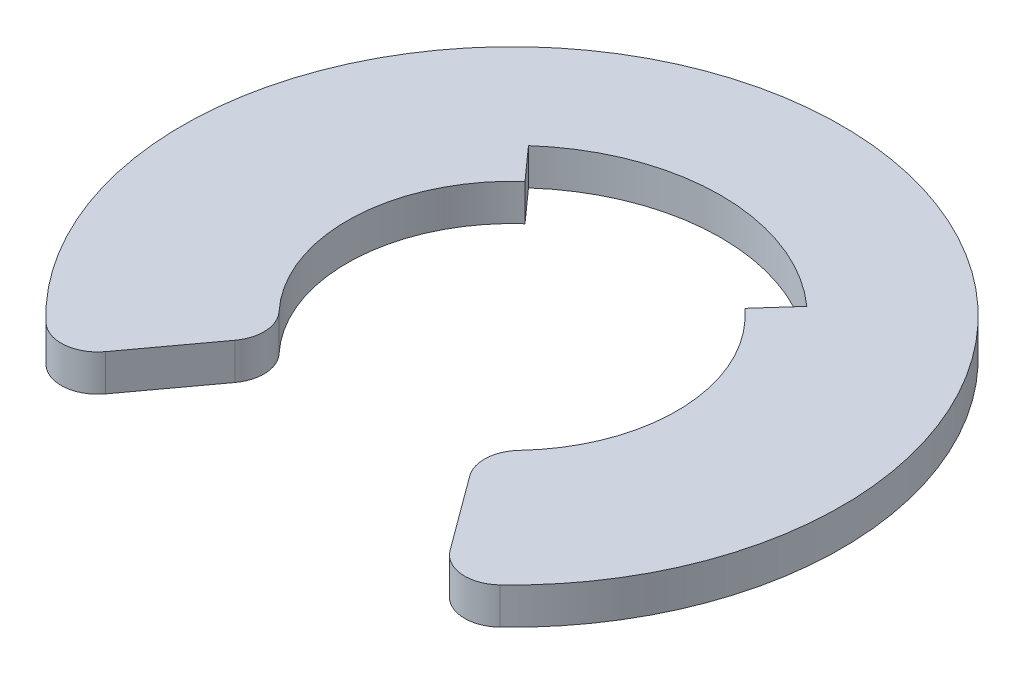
ISO-10303-21;
HEADER;
FILE_DESCRIPTION(('STEP AP214'),'2;1');
FILE_NAME('part.step','',(''),(''),'','','');
FILE_SCHEMA(('AUTOMOTIVE_DESIGN { 1 0 10303 214 1 1 1 1 }'));
ENDSEC;
DATA;
#1=APPLICATION_CONTEXT('core data for automotive mechanical design processes');
#2=APPLICATION_PROTOCOL_DEFINITION('international standard','automotive_design',2000,#1);
#3=PRODUCT_CONTEXT('',#1,'mechanical');
#4=PRODUCT('Part','Part','',(#3));
#5=PRODUCT_RELATED_PRODUCT_CATEGORY('part','',(#4));
#6=PRODUCT_DEFINITION_FORMATION('','',#4);
#7=PRODUCT_DEFINITION_CONTEXT('part definition',#1,'design');
#8=PRODUCT_DEFINITION('design','',#6,#7);
#9=PRODUCT_DEFINITION_SHAPE('','',#8);
#10=(LENGTH_UNIT() NAMED_UNIT(*) SI_UNIT(.MILLI.,.METRE.));
#11=(NAMED_UNIT(*) PLANE_ANGLE_UNIT() SI_UNIT($,.RADIAN.));
#12=(NAMED_UNIT(*) SI_UNIT($,.STERADIAN.) SOLID_ANGLE_UNIT());
#13=UNCERTAINTY_MEASURE_WITH_UNIT(LENGTH_MEASURE(1.E-05),#10,'distance_accuracy_value','');
#14=(GEOMETRIC_REPRESENTATION_CONTEXT(3) GLOBAL_UNCERTAINTY_ASSIGNED_CONTEXT((#13)) GLOBAL_UNIT_ASSIGNED_CONTEXT((#10,
#11,#12)) REPRESENTATION_CONTEXT('',''));
#15=CARTESIAN_POINT('',(0.,0.,0.));
#16=DIRECTION('',(0.,0.,1.));
#17=DIRECTION('',(1.,0.,0.));
#18=AXIS2_PLACEMENT_3D('',#15,#16,#17);
#19=CARTESIAN_POINT('',(0.,0.5,0.));
#20=DIRECTION('',(0.,1.,0.));
#21=DIRECTION('',(0.,0.,1.));
#22=AXIS2_PLACEMENT_3D('',#19,#20,#21);
#23=PLANE('',#22);
#24=CARTESIAN_POINT('',(0.,0.5,0.));
#25=DIRECTION('',(0.,1.,0.));
#26=DIRECTION('',(1.,0.,0.));
#27=AXIS2_PLACEMENT_3D('',#24,#25,#26);
#28=CIRCLE('',#27,2.85);
#29=CARTESIAN_POINT('',(1.9,0.5,-2.1242645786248));
#30=VERTEX_POINT('',#29);
#31=CARTESIAN_POINT('',(-1.9,0.5,-2.1242645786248));
#32=VERTEX_POINT('',#31);
#33=EDGE_CURVE('E135',#30,#32,#28,.T.);
#34=ORIENTED_EDGE('',*,*,#33,.F.);
#35=DIRECTION('',(-0.666666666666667,0.,0.74535599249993));
#36=VECTOR('',#35,1.);
#37=CARTESIAN_POINT('',(1.9,0.5,-2.1242645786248));
#38=LINE('',#37,#36);
#39=CARTESIAN_POINT('',(1.5,0.5,-1.67705098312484));
#40=VERTEX_POINT('',#39);
#41=EDGE_CURVE('E139',#30,#40,#38,.T.);
#42=ORIENTED_EDGE('',*,*,#41,.T.);
#43=CARTESIAN_POINT('',(0.,0.5,0.));
#44=DIRECTION('',(0.,1.,0.));
#45=DIRECTION('',(0.,0.,1.));
#46=AXIS2_PLACEMENT_3D('',#43,#44,#45);
#47=CIRCLE('',#46,2.25);
#48=CARTESIAN_POINT('',(1.64031567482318,0.5,1.54008586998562));
#49=VERTEX_POINT('',#48);
#50=EDGE_CURVE('E169',#49,#40,#47,.T.);
#51=ORIENTED_EDGE('',*,*,#50,.F.);
#52=CARTESIAN_POINT('',(2.00483026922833,0.5,1.88232717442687));
#53=DIRECTION('',(0.,1.,0.));
#54=DIRECTION('',(0.,0.,1.));
#55=AXIS2_PLACEMENT_3D('',#52,#53,#54);
#56=CIRCLE('',#55,0.5);
#57=CARTESIAN_POINT('',(1.60201800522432,0.5,2.1785404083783));
#58=VERTEX_POINT('',#57);
#59=EDGE_CURVE('E198',#49,#58,#56,.T.);
#60=ORIENTED_EDGE('',*,*,#59,.T.);
#61=DIRECTION('',(0.592426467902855,0.,0.805624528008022));
#62=VECTOR('',#61,1.);
#63=CARTESIAN_POINT('',(0.,0.5,0.));
#64=LINE('',#63,#62);
#65=CARTESIAN_POINT('',(2.35111965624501,0.5,3.19722322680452));
#66=VERTEX_POINT('',#65);
#67=EDGE_CURVE('E161',#58,#66,#64,.T.);
#68=ORIENTED_EDGE('',*,*,#67,.T.);
#69=CARTESIAN_POINT('',(2.75393192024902,0.5,2.9010099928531));
#70=DIRECTION('',(0.,1.,0.));
#71=DIRECTION('',(0.,0.,1.));
#72=AXIS2_PLACEMENT_3D('',#69,#70,#71);
#73=CIRCLE('',#72,0.5);
#74=CARTESIAN_POINT('',(3.09817341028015,0.5,3.26363624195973));
#75=VERTEX_POINT('',#74);
#76=EDGE_CURVE('E54',#66,#75,#73,.T.);
#77=ORIENTED_EDGE('',*,*,#76,.T.);
#78=CARTESIAN_POINT('',(0.,0.5,0.));
#79=DIRECTION('',(0.,1.,0.));
#80=DIRECTION('',(0.,0.,1.));
#81=AXIS2_PLACEMENT_3D('',#78,#79,#80);
#82=CIRCLE('',#81,4.5);
#83=CARTESIAN_POINT('',(-3.09817341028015,0.5,3.26363624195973));
#84=VERTEX_POINT('',#83);
#85=EDGE_CURVE('E172',#75,#84,#82,.T.);
#86=ORIENTED_EDGE('',*,*,#85,.T.);
#87=CARTESIAN_POINT('',(-2.75393192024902,0.5,2.9010099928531));
#88=DIRECTION('',(0.,1.,0.));
#89=DIRECTION('',(0.,0.,1.));
#90=AXIS2_PLACEMENT_3D('',#87,#88,#89);
#91=CIRCLE('',#90,0.5);
#92=CARTESIAN_POINT('',(-2.35111965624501,0.5,3.19722322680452));
#93=VERTEX_POINT('',#92);
#94=EDGE_CURVE('E201',#84,#93,#91,.T.);
#95=ORIENTED_EDGE('',*,*,#94,.T.);
#96=DIRECTION('',(0.592426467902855,0.,-0.805624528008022));
#97=VECTOR('',#96,1.);
#98=CARTESIAN_POINT('',(0.,0.5,0.));
#99=LINE('',#98,#97);
#100=CARTESIAN_POINT('',(-1.60201800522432,0.5,2.1785404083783));
#101=VERTEX_POINT('',#100);
#102=EDGE_CURVE('E155',#93,#101,#99,.T.);
#103=ORIENTED_EDGE('',*,*,#102,.T.);
#104=CARTESIAN_POINT('',(-2.00483026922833,0.5,1.88232717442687));
#105=DIRECTION('',(0.,1.,0.));
#106=DIRECTION('',(0.,0.,1.));
#107=AXIS2_PLACEMENT_3D('',#104,#105,#106);
#108=CIRCLE('',#107,0.5);
#109=CARTESIAN_POINT('',(-1.64031567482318,0.5,1.54008586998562));
#110=VERTEX_POINT('',#109);
#111=EDGE_CURVE('E195',#101,#110,#108,.T.);
#112=ORIENTED_EDGE('',*,*,#111,.T.);
#113=CARTESIAN_POINT('',(-1.5,0.5,-1.67705098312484));
#114=VERTEX_POINT('',#113);
#115=EDGE_CURVE('E164',#114,#110,#47,.T.);
#116=ORIENTED_EDGE('',*,*,#115,.F.);
#117=DIRECTION('',(-0.666666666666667,0.,-0.74535599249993));
#118=VECTOR('',#117,1.);
#119=CARTESIAN_POINT('',(-1.5,0.5,-1.67705098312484));
#120=LINE('',#119,#118);
#121=EDGE_CURVE('E46',#114,#32,#120,.T.);
#122=ORIENTED_EDGE('',*,*,#121,.T.);
#123=EDGE_LOOP('',(#34,#42,#51,#60,#68,#77,#86,#95,#103,#112,#116,#122));
#124=FACE_BOUND('',#123,.T.);
#125=ADVANCED_FACE('F31',(#124),#23,.T.);
#126=CARTESIAN_POINT('',(0.,0.,0.));
#127=DIRECTION('',(0.,1.,0.));
#128=DIRECTION('',(0.,0.,1.));
#129=AXIS2_PLACEMENT_3D('',#126,#127,#128);
#130=PLANE('',#129);
#131=DIRECTION('',(-0.666666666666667,0.,0.74535599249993));
#132=VECTOR('',#131,1.);
#133=CARTESIAN_POINT('',(1.9,0.,-2.1242645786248));
#134=LINE('',#133,#132);
#135=CARTESIAN_POINT('',(1.9,0.,-2.1242645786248));
#136=VERTEX_POINT('',#135);
#137=CARTESIAN_POINT('',(1.5,0.,-1.67705098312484));
#138=VERTEX_POINT('',#137);
#139=EDGE_CURVE('E127',#136,#138,#134,.T.);
#140=ORIENTED_EDGE('',*,*,#139,.F.);
#141=CARTESIAN_POINT('',(0.,0.,0.));
#142=DIRECTION('',(0.,1.,0.));
#143=DIRECTION('',(1.,0.,0.));
#144=AXIS2_PLACEMENT_3D('',#141,#142,#143);
#145=CIRCLE('',#144,2.85);
#146=CARTESIAN_POINT('',(-1.9,0.,-2.1242645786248));
#147=VERTEX_POINT('',#146);
#148=EDGE_CURVE('E128',#136,#147,#145,.T.);
#149=ORIENTED_EDGE('',*,*,#148,.T.);
#150=DIRECTION('',(-0.666666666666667,0.,-0.74535599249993));
#151=VECTOR('',#150,1.);
#152=CARTESIAN_POINT('',(-1.5,0.,-1.67705098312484));
#153=LINE('',#152,#151);
#154=CARTESIAN_POINT('',(-1.5,0.,-1.67705098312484));
#155=VERTEX_POINT('',#154);
#156=EDGE_CURVE('E118',#155,#147,#153,.T.);
#157=ORIENTED_EDGE('',*,*,#156,.F.);
#158=CARTESIAN_POINT('',(0.,0.,0.));
#159=DIRECTION('',(0.,1.,0.));
#160=DIRECTION('',(0.,0.,1.));
#161=AXIS2_PLACEMENT_3D('',#158,#159,#160);
#162=CIRCLE('',#161,2.25);
#163=CARTESIAN_POINT('',(-1.64031567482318,0.,1.54008586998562));
#164=VERTEX_POINT('',#163);
#165=EDGE_CURVE('E168',#155,#164,#162,.T.);
#166=ORIENTED_EDGE('',*,*,#165,.T.);
#167=CARTESIAN_POINT('',(-2.00483026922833,0.,1.88232717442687));
#168=DIRECTION('',(0.,1.,0.));
#169=DIRECTION('',(0.,0.,1.));
#170=AXIS2_PLACEMENT_3D('',#167,#168,#169);
#171=CIRCLE('',#170,0.5);
#172=CARTESIAN_POINT('',(-1.60201800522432,0.,2.1785404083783));
#173=VERTEX_POINT('',#172);
#174=EDGE_CURVE('E183',#164,#173,#171,.F.);
#175=ORIENTED_EDGE('',*,*,#174,.T.);
#176=DIRECTION('',(0.592426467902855,0.,-0.805624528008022));
#177=VECTOR('',#176,1.);
#178=CARTESIAN_POINT('',(0.,0.,0.));
#179=LINE('',#178,#177);
#180=CARTESIAN_POINT('',(-2.35111965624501,0.,3.19722322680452));
#181=VERTEX_POINT('',#180);
#182=EDGE_CURVE('E149',#181,#173,#179,.T.);
#183=ORIENTED_EDGE('',*,*,#182,.F.);
#184=CARTESIAN_POINT('',(-2.75393192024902,0.,2.9010099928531));
#185=DIRECTION('',(0.,1.,0.));
#186=DIRECTION('',(0.,0.,1.));
#187=AXIS2_PLACEMENT_3D('',#184,#185,#186);
#188=CIRCLE('',#187,0.5);
#189=CARTESIAN_POINT('',(-3.09817341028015,0.,3.26363624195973));
#190=VERTEX_POINT('',#189);
#191=EDGE_CURVE('E189',#181,#190,#188,.F.);
#192=ORIENTED_EDGE('',*,*,#191,.T.);
#193=CARTESIAN_POINT('',(0.,0.,0.));
#194=DIRECTION('',(0.,1.,0.));
#195=DIRECTION('',(0.,0.,1.));
#196=AXIS2_PLACEMENT_3D('',#193,#194,#195);
#197=CIRCLE('',#196,4.5);
#198=CARTESIAN_POINT('',(3.09817341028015,0.,3.26363624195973));
#199=VERTEX_POINT('',#198);
#200=EDGE_CURVE('E167',#199,#190,#197,.T.);
#201=ORIENTED_EDGE('',*,*,#200,.F.);
#202=CARTESIAN_POINT('',(2.75393192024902,0.,2.9010099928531));
#203=DIRECTION('',(0.,1.,0.));
#204=DIRECTION('',(0.,0.,1.));
#205=AXIS2_PLACEMENT_3D('',#202,#203,#204);
#206=CIRCLE('',#205,0.5);
#207=CARTESIAN_POINT('',(2.35111965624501,0.,3.19722322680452));
#208=VERTEX_POINT('',#207);
#209=EDGE_CURVE('E187',#199,#208,#206,.F.);
#210=ORIENTED_EDGE('',*,*,#209,.T.);
#211=DIRECTION('',(0.592426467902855,0.,0.805624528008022));
#212=VECTOR('',#211,1.);
#213=CARTESIAN_POINT('',(0.,0.,0.));
#214=LINE('',#213,#212);
#215=CARTESIAN_POINT('',(1.60201800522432,0.,2.1785404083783));
#216=VERTEX_POINT('',#215);
#217=EDGE_CURVE('E158',#216,#208,#214,.T.);
#218=ORIENTED_EDGE('',*,*,#217,.F.);
#219=CARTESIAN_POINT('',(2.00483026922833,0.,1.88232717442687));
#220=DIRECTION('',(0.,1.,0.));
#221=DIRECTION('',(0.,0.,1.));
#222=AXIS2_PLACEMENT_3D('',#219,#220,#221);
#223=CIRCLE('',#222,0.5);
#224=CARTESIAN_POINT('',(1.64031567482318,0.,1.54008586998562));
#225=VERTEX_POINT('',#224);
#226=EDGE_CURVE('E185',#216,#225,#223,.F.);
#227=ORIENTED_EDGE('',*,*,#226,.T.);
#228=EDGE_CURVE('E165',#225,#138,#162,.T.);
#229=ORIENTED_EDGE('',*,*,#228,.T.);
#230=EDGE_LOOP('',(#140,#149,#157,#166,#175,#183,#192,#201,#210,#218,#227,#229));
#231=FACE_BOUND('',#230,.T.);
#232=ADVANCED_FACE('F137',(#231),#130,.F.);
#233=CARTESIAN_POINT('',(0.,0.,0.));
#234=DIRECTION('',(0.,1.,0.));
#235=DIRECTION('',(0.,0.,1.));
#236=AXIS2_PLACEMENT_3D('',#233,#234,#235);
#237=CYLINDRICAL_SURFACE('',#236,2.25);
#238=DIRECTION('',(0.,1.,0.));
#239=VECTOR('',#238,1.);
#240=CARTESIAN_POINT('',(1.5,0.,-1.67705098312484));
#241=LINE('',#240,#239);
#242=EDGE_CURVE('E150',#138,#40,#241,.T.);
#243=ORIENTED_EDGE('',*,*,#242,.F.);
#244=ORIENTED_EDGE('',*,*,#228,.F.);
#245=DIRECTION('',(0.,1.,0.));
#246=VECTOR('',#245,1.);
#247=CARTESIAN_POINT('',(1.64031567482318,0.,1.54008586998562));
#248=LINE('',#247,#246);
#249=EDGE_CURVE('E11',#225,#49,#248,.T.);
#250=ORIENTED_EDGE('',*,*,#249,.T.);
#251=ORIENTED_EDGE('',*,*,#50,.T.);
#252=EDGE_LOOP('',(#243,#244,#250,#251));
#253=FACE_BOUND('',#252,.T.);
#254=ADVANCED_FACE('F242',(#253),#237,.F.);
#255=DIRECTION('',(0.,1.,0.));
#256=VECTOR('',#255,1.);
#257=CARTESIAN_POINT('',(-1.5,0.,-1.67705098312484));
#258=LINE('',#257,#256);
#259=EDGE_CURVE('E123',#155,#114,#258,.T.);
#260=ORIENTED_EDGE('',*,*,#259,.T.);
#261=ORIENTED_EDGE('',*,*,#115,.T.);
#262=DIRECTION('',(0.,1.,0.));
#263=VECTOR('',#262,1.);
#264=CARTESIAN_POINT('',(-1.64031567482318,0.,1.54008586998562));
#265=LINE('',#264,#263);
#266=EDGE_CURVE('E39',#110,#164,#265,.F.);
#267=ORIENTED_EDGE('',*,*,#266,.T.);
#268=ORIENTED_EDGE('',*,*,#165,.F.);
#269=EDGE_LOOP('',(#260,#261,#267,#268));
#270=FACE_BOUND('',#269,.T.);
#271=ADVANCED_FACE('F211',(#270),#237,.F.);
#272=CARTESIAN_POINT('',(0.,0.5,0.));
#273=DIRECTION('',(0.,-1.,0.));
#274=DIRECTION('',(0.,0.,-1.));
#275=AXIS2_PLACEMENT_3D('',#272,#273,#274);
#276=CYLINDRICAL_SURFACE('',#275,4.5);
#277=ORIENTED_EDGE('',*,*,#200,.T.);
#278=DIRECTION('',(0.,-1.,0.));
#279=VECTOR('',#278,1.);
#280=CARTESIAN_POINT('',(-3.09817341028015,0.5,3.26363624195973));
#281=LINE('',#280,#279);
#282=EDGE_CURVE('E193',#190,#84,#281,.F.);
#283=ORIENTED_EDGE('',*,*,#282,.T.);
#284=ORIENTED_EDGE('',*,*,#85,.F.);
#285=DIRECTION('',(0.,-1.,0.));
#286=VECTOR('',#285,1.);
#287=CARTESIAN_POINT('',(3.09817341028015,0.5,3.26363624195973));
#288=LINE('',#287,#286);
#289=EDGE_CURVE('E191',#75,#199,#288,.T.);
#290=ORIENTED_EDGE('',*,*,#289,.T.);
#291=EDGE_LOOP('',(#277,#283,#284,#290));
#292=FACE_BOUND('',#291,.T.);
#293=ADVANCED_FACE('F227',(#292),#276,.T.);
#294=CARTESIAN_POINT('',(0.,16.4221740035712,0.));
#295=DIRECTION('',(0.805624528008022,0.,0.592426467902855));
#296=DIRECTION('',(0.592426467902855,0.,-0.805624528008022));
#297=AXIS2_PLACEMENT_3D('',#294,#295,#296);
#298=PLANE('',#297);
#299=ORIENTED_EDGE('',*,*,#102,.F.);
#300=DIRECTION('',(0.,1.,0.));
#301=VECTOR('',#300,1.);
#302=CARTESIAN_POINT('',(-2.35111965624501,0.,3.19722322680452));
#303=LINE('',#302,#301);
#304=EDGE_CURVE('E180',#93,#181,#303,.F.);
#305=ORIENTED_EDGE('',*,*,#304,.T.);
#306=ORIENTED_EDGE('',*,*,#182,.T.);
#307=DIRECTION('',(0.,-1.,0.));
#308=VECTOR('',#307,1.);
#309=CARTESIAN_POINT('',(-1.60201800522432,0.5,2.1785404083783));
#310=LINE('',#309,#308);
#311=EDGE_CURVE('E175',#173,#101,#310,.F.);
#312=ORIENTED_EDGE('',*,*,#311,.T.);
#313=EDGE_LOOP('',(#299,#305,#306,#312));
#314=FACE_BOUND('',#313,.T.);
#315=ADVANCED_FACE('F218',(#314),#298,.T.);
#316=CARTESIAN_POINT('',(0.,16.4221740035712,0.));
#317=DIRECTION('',(-0.805624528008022,0.,0.592426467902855));
#318=DIRECTION('',(0.592426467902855,0.,0.805624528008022));
#319=AXIS2_PLACEMENT_3D('',#316,#317,#318);
#320=PLANE('',#319);
#321=ORIENTED_EDGE('',*,*,#217,.T.);
#322=DIRECTION('',(0.,1.,0.));
#323=VECTOR('',#322,1.);
#324=CARTESIAN_POINT('',(2.35111965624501,0.5,3.19722322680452));
#325=LINE('',#324,#323);
#326=EDGE_CURVE('E206',#208,#66,#325,.T.);
#327=ORIENTED_EDGE('',*,*,#326,.T.);
#328=ORIENTED_EDGE('',*,*,#67,.F.);
#329=DIRECTION('',(0.,-1.,0.));
#330=VECTOR('',#329,1.);
#331=CARTESIAN_POINT('',(1.60201800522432,0.,2.1785404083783));
#332=LINE('',#331,#330);
#333=EDGE_CURVE('E203',#58,#216,#332,.T.);
#334=ORIENTED_EDGE('',*,*,#333,.T.);
#335=EDGE_LOOP('',(#321,#327,#328,#334));
#336=FACE_BOUND('',#335,.T.);
#337=ADVANCED_FACE('F232',(#336),#320,.T.);
#338=CARTESIAN_POINT('',(-2.75393192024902,0.5,2.9010099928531));
#339=DIRECTION('',(0.,-1.,0.));
#340=DIRECTION('',(0.,0.,-1.));
#341=AXIS2_PLACEMENT_3D('',#338,#339,#340);
#342=CYLINDRICAL_SURFACE('',#341,0.5);
#343=ORIENTED_EDGE('',*,*,#94,.F.);
#344=ORIENTED_EDGE('',*,*,#282,.F.);
#345=ORIENTED_EDGE('',*,*,#191,.F.);
#346=ORIENTED_EDGE('',*,*,#304,.F.);
#347=EDGE_LOOP('',(#343,#344,#345,#346));
#348=FACE_BOUND('',#347,.T.);
#349=ADVANCED_FACE('F222',(#348),#342,.T.);
#350=CARTESIAN_POINT('',(2.75393192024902,0.5,2.9010099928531));
#351=DIRECTION('',(0.,-1.,0.));
#352=DIRECTION('',(0.,0.,-1.));
#353=AXIS2_PLACEMENT_3D('',#350,#351,#352);
#354=CYLINDRICAL_SURFACE('',#353,0.5);
#355=ORIENTED_EDGE('',*,*,#209,.F.);
#356=ORIENTED_EDGE('',*,*,#289,.F.);
#357=ORIENTED_EDGE('',*,*,#76,.F.);
#358=ORIENTED_EDGE('',*,*,#326,.F.);
#359=EDGE_LOOP('',(#355,#356,#357,#358));
#360=FACE_BOUND('',#359,.T.);
#361=ADVANCED_FACE('F229',(#360),#354,.T.);
#362=CARTESIAN_POINT('',(2.00483026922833,0.,1.88232717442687));
#363=DIRECTION('',(0.,1.,0.));
#364=DIRECTION('',(0.,0.,1.));
#365=AXIS2_PLACEMENT_3D('',#362,#363,#364);
#366=CYLINDRICAL_SURFACE('',#365,0.5);
#367=ORIENTED_EDGE('',*,*,#59,.F.);
#368=ORIENTED_EDGE('',*,*,#249,.F.);
#369=ORIENTED_EDGE('',*,*,#226,.F.);
#370=ORIENTED_EDGE('',*,*,#333,.F.);
#371=EDGE_LOOP('',(#367,#368,#369,#370));
#372=FACE_BOUND('',#371,.T.);
#373=ADVANCED_FACE('F237',(#372),#366,.T.);
#374=CARTESIAN_POINT('',(-2.00483026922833,0.,1.88232717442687));
#375=DIRECTION('',(0.,1.,0.));
#376=DIRECTION('',(0.,0.,1.));
#377=AXIS2_PLACEMENT_3D('',#374,#375,#376);
#378=CYLINDRICAL_SURFACE('',#377,0.5);
#379=ORIENTED_EDGE('',*,*,#174,.F.);
#380=ORIENTED_EDGE('',*,*,#266,.F.);
#381=ORIENTED_EDGE('',*,*,#111,.F.);
#382=ORIENTED_EDGE('',*,*,#311,.F.);
#383=EDGE_LOOP('',(#379,#380,#381,#382));
#384=FACE_BOUND('',#383,.T.);
#385=ADVANCED_FACE('F33',(#384),#378,.T.);
#386=CARTESIAN_POINT('',(0.,0.,0.));
#387=DIRECTION('',(0.,1.,0.));
#388=DIRECTION('',(0.,0.,1.));
#389=AXIS2_PLACEMENT_3D('',#386,#387,#388);
#390=CYLINDRICAL_SURFACE('',#389,2.85);
#391=ORIENTED_EDGE('',*,*,#33,.T.);
#392=DIRECTION('',(0.,1.,0.));
#393=VECTOR('',#392,1.);
#394=CARTESIAN_POINT('',(-1.9,0.,-2.1242645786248));
#395=LINE('',#394,#393);
#396=EDGE_CURVE('E121',#147,#32,#395,.T.);
#397=ORIENTED_EDGE('',*,*,#396,.F.);
#398=ORIENTED_EDGE('',*,*,#148,.F.);
#399=DIRECTION('',(0.,1.,0.));
#400=VECTOR('',#399,1.);
#401=CARTESIAN_POINT('',(1.9,0.,-2.1242645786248));
#402=LINE('',#401,#400);
#403=EDGE_CURVE('E147',#136,#30,#402,.T.);
#404=ORIENTED_EDGE('',*,*,#403,.T.);
#405=EDGE_LOOP('',(#391,#397,#398,#404));
#406=FACE_BOUND('',#405,.T.);
#407=ADVANCED_FACE('F132',(#406),#390,.F.);
#408=CARTESIAN_POINT('',(1.9,0.,-2.1242645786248));
#409=DIRECTION('',(-0.74535599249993,0.,-0.666666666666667));
#410=DIRECTION('',(-0.666666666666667,0.,0.74535599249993));
#411=AXIS2_PLACEMENT_3D('',#408,#409,#410);
#412=PLANE('',#411);
#413=ORIENTED_EDGE('',*,*,#41,.F.);
#414=ORIENTED_EDGE('',*,*,#403,.F.);
#415=ORIENTED_EDGE('',*,*,#139,.T.);
#416=ORIENTED_EDGE('',*,*,#242,.T.);
#417=EDGE_LOOP('',(#413,#414,#415,#416));
#418=FACE_BOUND('',#417,.T.);
#419=ADVANCED_FACE('F246',(#418),#412,.T.);
#420=CARTESIAN_POINT('',(-1.5,0.,-1.67705098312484));
#421=DIRECTION('',(0.74535599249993,0.,-0.666666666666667));
#422=DIRECTION('',(-0.666666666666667,0.,-0.74535599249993));
#423=AXIS2_PLACEMENT_3D('',#420,#421,#422);
#424=PLANE('',#423);
#425=ORIENTED_EDGE('',*,*,#121,.F.);
#426=ORIENTED_EDGE('',*,*,#259,.F.);
#427=ORIENTED_EDGE('',*,*,#156,.T.);
#428=ORIENTED_EDGE('',*,*,#396,.T.);
#429=EDGE_LOOP('',(#425,#426,#427,#428));
#430=FACE_BOUND('',#429,.T.);
#431=ADVANCED_FACE('F120',(#430),#424,.T.);
#432=CLOSED_SHELL('',(#125,#232,#254,#271,#293,#315,#337,#349,#361,#373,#385,#407,#419,#431));
#433=MANIFOLD_SOLID_BREP('B2',#432);
#434=ADVANCED_BREP_SHAPE_REPRESENTATION('',(#18,#433),#14);
#435=SHAPE_DEFINITION_REPRESENTATION(#9,#434);
ENDSEC;
END-ISO-10303-21;
